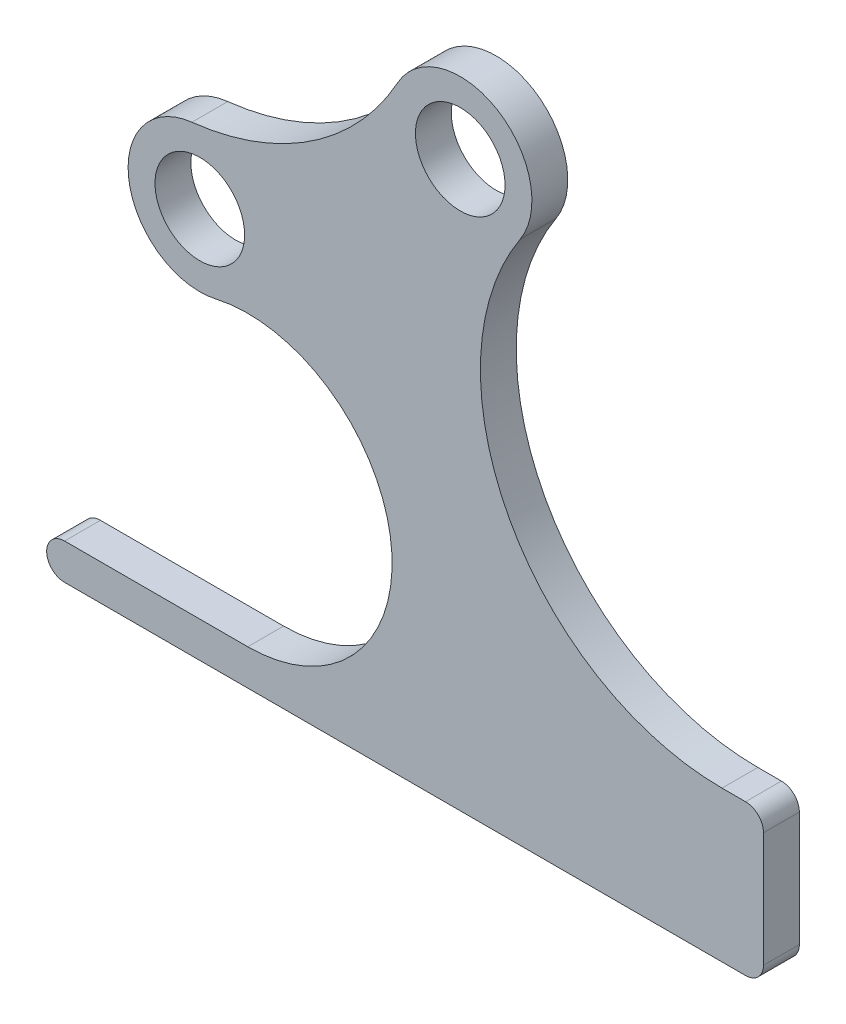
from build123d import *

# Parameters (mm, degrees)
ESQUISSE1_R        = 12.5
BOSS_EXTRU_1_DEPTH = 10


with BuildPart() as part:
    # Esquisse1 → Boss.-Extru.1 (new body)
    with BuildSketch(Plane.XY):
        with BuildLine():
            Line((0, 0), (-126.091296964, 0))
            ThreePointArc((-126.091296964, 0), (-131.091296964, 5), (-126.091296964, 10))
            Line((-126.091296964, 10), (-74.988829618, 10))
            ThreePointArc((-74.988829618, 10), (-34.955915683, 54.78212875), (-83.927368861, 89.565314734))
            ThreePointArc((-83.927368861, 89.565314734), (-108.087238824, 105.744848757), (-90.560480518, 128.945912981))
            ThreePointArc((-90.560480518, 128.945912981), (-57.23250294, 141.061146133), (-33.195927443, 167.133660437))
            ThreePointArc((-33.195927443, 167.133660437), (-5.353852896, 174.551932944), (1.007675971, 146.449569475))
            ThreePointArc((1.007675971, 146.449569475), (-2.000766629, 77.415074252), (57.33374924, 42))
            Line((57.33374924, 42), (63.908703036, 42))
            ThreePointArc((63.908703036, 42), (67.444236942, 40.535533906), (68.908703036, 37))
            Line((68.908703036, 37), (68.908703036, 5))
            ThreePointArc((68.908703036, 5), (67.444236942, 1.464466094), (63.908703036, 0))
            Line((63.908703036, 0), (0, 0))
        make_face()
        with Locations((-15.703281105, 157.437923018)):
            Circle(ESQUISSE1_R, mode=Mode.SUBTRACT)
        with Locations((-88.365048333, 109.066776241)):
            Circle(ESQUISSE1_R, mode=Mode.SUBTRACT)
    extrude(amount=BOSS_EXTRU_1_DEPTH)


solid = part.part
